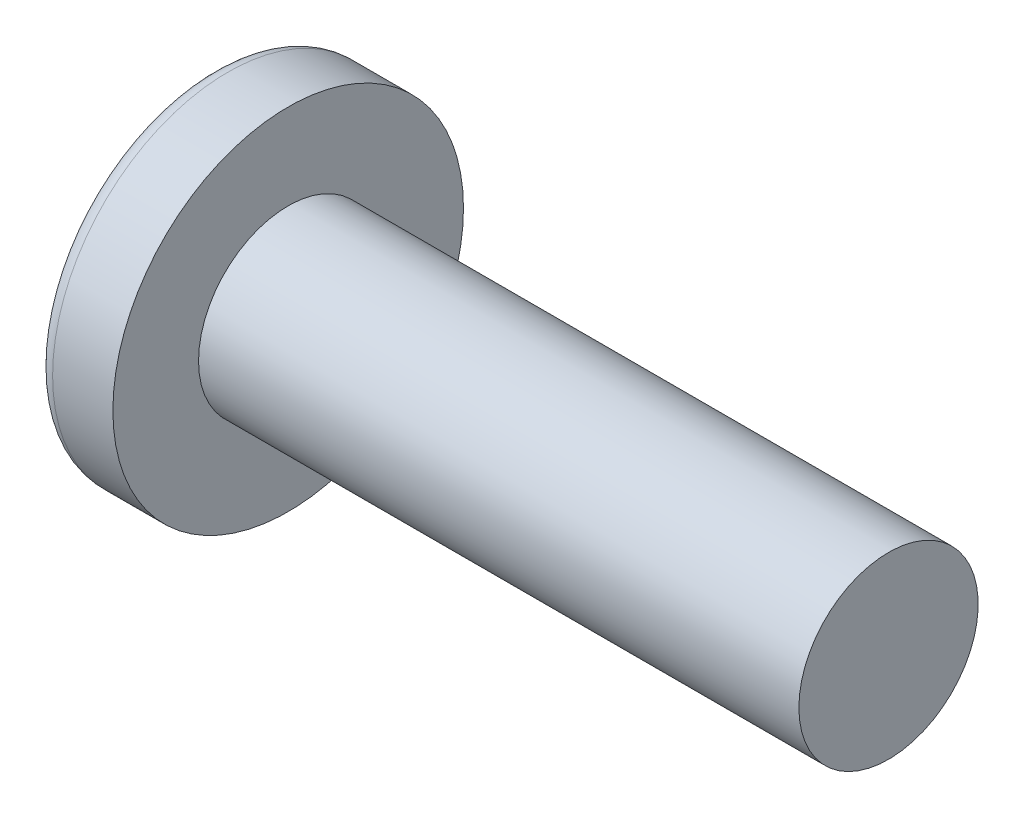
from build123d import *

# Parameters (mm, degrees)
CIRPATTERN1_COUNT = 2
CIRPATTERN1_ANGLE = 90


with BuildPart() as part:
    # BodySke → Base-Revolve (revolve)
    with BuildSketch(Plane.XY, mode=Mode.PRIVATE) as base_revolve_sk:
        with BuildLine():
            Line((2.032, 1.4224), (2.032, 2.7813))
            Line((2.032, 2.7813), (1.075646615, 2.7813))
            ThreePointArc((1.075646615, 2.7813), (0.960371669, 2.753635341), (0.87020729, 2.676667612))
            ThreePointArc((0.87020729, 2.676667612), (0.223015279, 1.407285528), (0, 0))
            Line((0, 0), (11.557, 0))
            Line((11.557, 0), (11.557, 1.4224))
            Line((11.557, 1.4224), (2.032, 1.4224))
        make_face()
    revolve(base_revolve_sk.sketch.rotate(Axis((-25.4, 0, 0), (1, 0, 0)), 90), axis=Axis((-25.4, 0, 0), (1, 0, 0)))

    # Sketch3 → Cut-Loft1 section 0
    with BuildSketch(Plane(origin=(0, 0, 0), x_dir=(0, 0, -1), z_dir=(1, 0, 0))):
        with BuildLine():
            Line((0.4064, -1.8161), (-0.4064, -1.8161))
            Line((-0.4064, -1.8161), (-0.4064, 1.8161))
            Line((-0.4064, 1.8161), (0.4064, 1.8161))
            Line((0.4064, 1.8161), (0.4064, -1.8161))
        make_face()
    # Sketch4 → Cut-Loft1 section 1
    with BuildSketch(Plane(origin=(2.0066, 0, 0), x_dir=(0, 0, -1), z_dir=(1, 0, 0))):
        with BuildLine():
            Line((0.2032, -0.2032), (-0.2032, -0.2032))
            Line((-0.2032, -0.2032), (-0.2032, 0.2032))
            Line((-0.2032, 0.2032), (0.2032, 0.2032))
            Line((0.2032, 0.2032), (0.2032, -0.2032))
        make_face()
    cut_loft1 = loft(mode=Mode.SUBTRACT)

    # CirPattern1: Cut-Loft1 ×2 about axis
    cirpattern1_axis = Axis((0, 0, 0), (1, 0, 0))
    for i in range(1, CIRPATTERN1_COUNT):
        add(cut_loft1.rotate(cirpattern1_axis, i * CIRPATTERN1_ANGLE / (CIRPATTERN1_COUNT - 1)), mode=Mode.SUBTRACT)


solid = part.part
